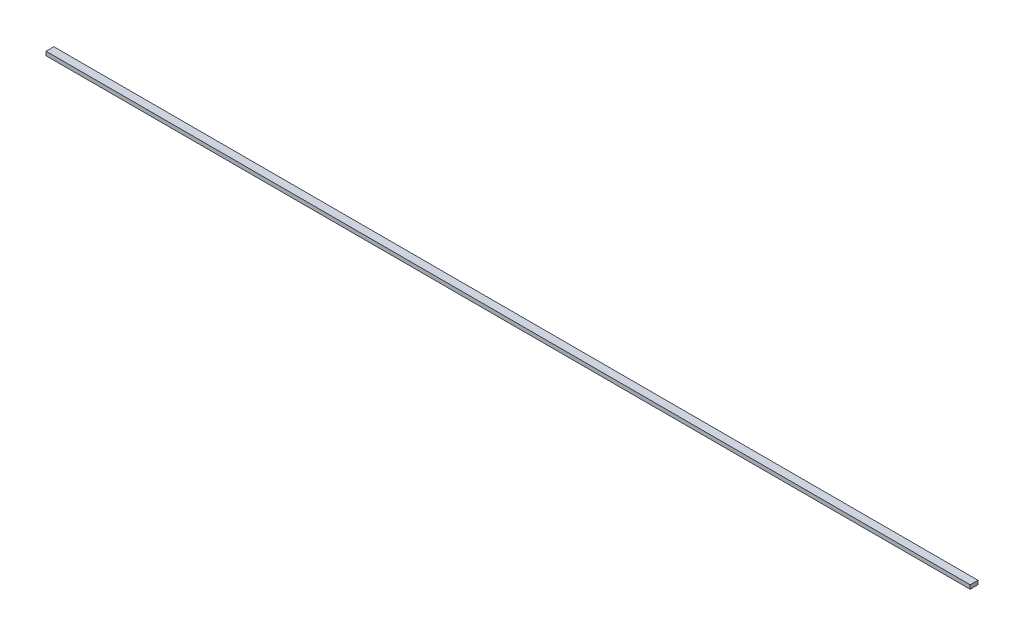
from build123d import *

# Parameters (mm, degrees)
SKETCH1_W           = 2997.2
SKETCH1_H           = 25.4
BOSS_EXTRUDE1_DEPTH = 12.7


with BuildPart() as part:
    # Sketch1 → Boss-Extrude1 (new body)
    with BuildSketch(Plane(origin=(0, 0, 0), x_dir=(1, 0, 0), z_dir=(0, 1, 0))):
        with Locations((1408.266950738, 31.245195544)):
            Rectangle(SKETCH1_W, SKETCH1_H)
    extrude(amount=BOSS_EXTRUDE1_DEPTH)


solid = part.part
